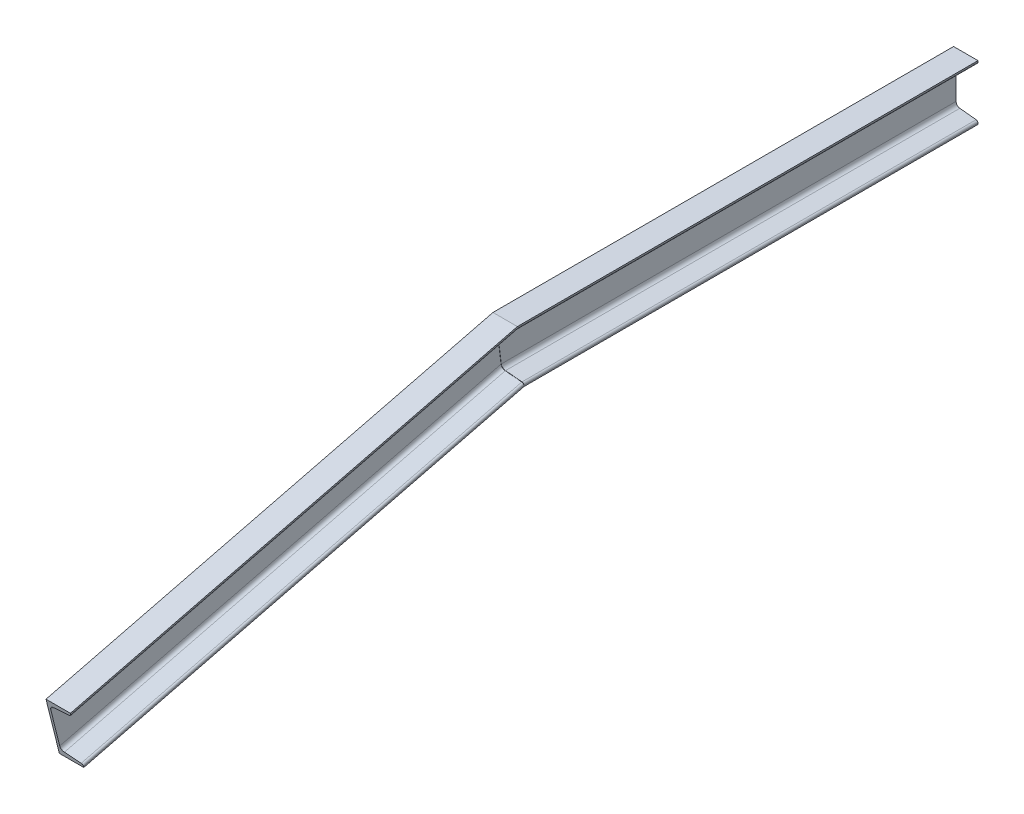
ISO-10303-21;
HEADER;
FILE_DESCRIPTION(('STEP AP214'),'2;1');
FILE_NAME('part.step','',(''),(''),'','','');
FILE_SCHEMA(('AUTOMOTIVE_DESIGN { 1 0 10303 214 1 1 1 1 }'));
ENDSEC;
DATA;
#1=APPLICATION_CONTEXT('core data for automotive mechanical design processes');
#2=APPLICATION_PROTOCOL_DEFINITION('international standard','automotive_design',2000,#1);
#3=PRODUCT_CONTEXT('',#1,'mechanical');
#4=PRODUCT('Part','Part','',(#3));
#5=PRODUCT_RELATED_PRODUCT_CATEGORY('part','',(#4));
#6=PRODUCT_DEFINITION_FORMATION('','',#4);
#7=PRODUCT_DEFINITION_CONTEXT('part definition',#1,'design');
#8=PRODUCT_DEFINITION('design','',#6,#7);
#9=PRODUCT_DEFINITION_SHAPE('','',#8);
#10=(LENGTH_UNIT() NAMED_UNIT(*) SI_UNIT(.MILLI.,.METRE.));
#11=(NAMED_UNIT(*) PLANE_ANGLE_UNIT() SI_UNIT($,.RADIAN.));
#12=(NAMED_UNIT(*) SI_UNIT($,.STERADIAN.) SOLID_ANGLE_UNIT());
#13=UNCERTAINTY_MEASURE_WITH_UNIT(LENGTH_MEASURE(1.E-05),#10,'distance_accuracy_value','');
#14=(GEOMETRIC_REPRESENTATION_CONTEXT(3) GLOBAL_UNCERTAINTY_ASSIGNED_CONTEXT((#13)) GLOBAL_UNIT_ASSIGNED_CONTEXT((#10,
#11,#12)) REPRESENTATION_CONTEXT('',''));
#15=CARTESIAN_POINT('',(0.,0.,0.));
#16=DIRECTION('',(0.,0.,1.));
#17=DIRECTION('',(1.,0.,0.));
#18=AXIS2_PLACEMENT_3D('',#15,#16,#17);
#19=CARTESIAN_POINT('',(53.,-60.,1000.));
#20=DIRECTION('',(-1.,0.,0.));
#21=DIRECTION('',(0.,0.,1.));
#22=AXIS2_PLACEMENT_3D('',#19,#20,#21);
#23=PLANE('',#22);
#24=DIRECTION('',(0.,0.992546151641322,0.121869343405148));
#25=VECTOR('',#24,1.);
#26=CARTESIAN_POINT('',(53.,-58.2421174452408,985.683195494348));
#27=LINE('',#26,#25);
#28=CARTESIAN_POINT('',(53.,-60.048747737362,985.461369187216));
#29=VERTEX_POINT('',#28);
#30=CARTESIAN_POINT('',(53.,-57.5999255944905,985.762046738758));
#31=VERTEX_POINT('',#30);
#32=EDGE_CURVE('E239',#29,#31,#27,.T.);
#33=ORIENTED_EDGE('',*,*,#32,.T.);
#34=DIRECTION('',(0.,0.241921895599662,-0.970295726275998));
#35=VECTOR('',#34,1.);
#36=CARTESIAN_POINT('',(53.,-295.981301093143,1941.85752249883));
#37=LINE('',#36,#35);
#38=CARTESIAN_POINT('',(53.,-295.981301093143,1941.85752249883));
#39=VERTEX_POINT('',#38);
#40=EDGE_CURVE('E294',#39,#31,#37,.T.);
#41=ORIENTED_EDGE('',*,*,#40,.F.);
#42=DIRECTION('',(0.,-0.970295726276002,-0.241921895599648));
#43=VECTOR('',#42,1.);
#44=CARTESIAN_POINT('',(53.,-295.981301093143,1941.85752249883));
#45=LINE('',#44,#43);
#46=CARTESIAN_POINT('',(53.,-298.357382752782,1941.26509880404));
#47=VERTEX_POINT('',#46);
#48=EDGE_CURVE('E280',#39,#47,#45,.T.);
#49=ORIENTED_EDGE('',*,*,#48,.T.);
#50=DIRECTION('',(0.,0.241921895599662,-0.970295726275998));
#51=VECTOR('',#50,1.);
#52=CARTESIAN_POINT('',(53.,-298.357382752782,1941.26509880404));
#53=LINE('',#52,#51);
#54=EDGE_CURVE('E291',#47,#29,#53,.T.);
#55=ORIENTED_EDGE('',*,*,#54,.T.);
#56=EDGE_LOOP('',(#33,#41,#49,#55));
#57=FACE_BOUND('',#56,.T.);
#58=ADVANCED_FACE('F39',(#57),#23,.F.);
#59=CARTESIAN_POINT('',(5.50000000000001,-40.3976442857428,1000.));
#60=DIRECTION('',(-1.,0.,0.));
#61=DIRECTION('',(0.,-1.,0.));
#62=AXIS2_PLACEMENT_3D('',#59,#60,#61);
#63=PLANE('',#62);
#64=DIRECTION('',(0.,0.241921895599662,-0.970295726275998));
#65=VECTOR('',#64,1.);
#66=CARTESIAN_POINT('',(5.50000000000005,-279.337300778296,1946.00733785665));
#67=LINE('',#66,#65);
#68=CARTESIAN_POINT('',(5.50000000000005,-279.337300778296,1946.00733785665));
#69=VERTEX_POINT('',#68);
#70=CARTESIAN_POINT('',(5.50000000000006,-40.4463920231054,987.868235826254));
#71=VERTEX_POINT('',#70);
#72=EDGE_CURVE('E62',#69,#71,#67,.T.);
#73=ORIENTED_EDGE('',*,*,#72,.T.);
#74=DIRECTION('',(0.,0.992546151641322,0.121869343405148));
#75=VECTOR('',#74,1.);
#76=CARTESIAN_POINT('',(5.50000000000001,-38.9308986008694,988.054315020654));
#77=LINE('',#76,#75);
#78=CARTESIAN_POINT('',(5.50000000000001,40.3488965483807,997.788649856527));
#79=VERTEX_POINT('',#78);
#80=EDGE_CURVE('E242',#71,#79,#77,.T.);
#81=ORIENTED_EDGE('',*,*,#80,.T.);
#82=DIRECTION('',(0.,0.241921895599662,-0.970295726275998));
#83=VECTOR('',#82,1.);
#84=CARTESIAN_POINT('',(5.50000000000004,-200.941977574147,1965.55348722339));
#85=LINE('',#84,#83);
#86=CARTESIAN_POINT('',(5.50000000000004,-200.941977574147,1965.55348722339));
#87=VERTEX_POINT('',#86);
#88=EDGE_CURVE('E301',#87,#79,#85,.T.);
#89=ORIENTED_EDGE('',*,*,#88,.F.);
#90=DIRECTION('',(0.,-0.970295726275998,-0.241921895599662));
#91=VECTOR('',#90,1.);
#92=CARTESIAN_POINT('',(5.50000000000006,-200.941977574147,1965.55348722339));
#93=LINE('',#92,#91);
#94=EDGE_CURVE('E269',#87,#69,#93,.T.);
#95=ORIENTED_EDGE('',*,*,#94,.T.);
#96=EDGE_LOOP('',(#73,#81,#89,#95));
#97=FACE_BOUND('',#96,.T.);
#98=ADVANCED_FACE('F456',(#97),#63,.F.);
#99=CARTESIAN_POINT('',(0.,-60.,1000.));
#100=DIRECTION('',(0.,1.,0.));
#101=DIRECTION('',(0.,0.,1.));
#102=AXIS2_PLACEMENT_3D('',#99,#100,#101);
#103=PLANE('',#102);
#104=DIRECTION('',(0.,0.,-1.));
#105=VECTOR('',#104,1.);
#106=CARTESIAN_POINT('',(53.,-60.,1000.));
#107=LINE('',#106,#105);
#108=CARTESIAN_POINT('',(53.,-60.,985.064350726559));
#109=VERTEX_POINT('',#108);
#110=CARTESIAN_POINT('',(53.,-60.,0.));
#111=VERTEX_POINT('',#110);
#112=EDGE_CURVE('E211',#109,#111,#107,.T.);
#113=ORIENTED_EDGE('',*,*,#112,.F.);
#114=DIRECTION('',(-1.,0.,0.));
#115=VECTOR('',#114,1.);
#116=CARTESIAN_POINT('',(0.,-60.,985.064350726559));
#117=LINE('',#116,#115);
#118=CARTESIAN_POINT('',(0.,-60.,985.064350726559));
#119=VERTEX_POINT('',#118);
#120=EDGE_CURVE('E223',#109,#119,#117,.T.);
#121=ORIENTED_EDGE('',*,*,#120,.T.);
#122=DIRECTION('',(0.,0.,-1.));
#123=VECTOR('',#122,1.);
#124=CARTESIAN_POINT('',(0.,-60.,1000.));
#125=LINE('',#124,#123);
#126=CARTESIAN_POINT('',(0.,-60.,0.));
#127=VERTEX_POINT('',#126);
#128=EDGE_CURVE('E373',#119,#127,#125,.T.);
#129=ORIENTED_EDGE('',*,*,#128,.T.);
#130=DIRECTION('',(1.,0.,0.));
#131=VECTOR('',#130,1.);
#132=CARTESIAN_POINT('',(0.,-60.,0.));
#133=LINE('',#132,#131);
#134=EDGE_CURVE('E327',#127,#111,#133,.T.);
#135=ORIENTED_EDGE('',*,*,#134,.T.);
#136=EDGE_LOOP('',(#113,#121,#129,#135));
#137=FACE_BOUND('',#136,.T.);
#138=ADVANCED_FACE('F417',(#137),#103,.F.);
#139=CARTESIAN_POINT('',(53.,60.,1000.));
#140=DIRECTION('',(0.,-1.,0.));
#141=DIRECTION('',(1.,0.,0.));
#142=AXIS2_PLACEMENT_3D('',#139,#140,#141);
#143=PLANE('',#142);
#144=DIRECTION('',(-1.,0.,0.));
#145=VECTOR('',#144,1.);
#146=CARTESIAN_POINT('',(53.,60.,0.));
#147=LINE('',#146,#145);
#148=CARTESIAN_POINT('',(53.,60.,0.));
#149=VERTEX_POINT('',#148);
#150=CARTESIAN_POINT('',(0.,60.,0.));
#151=VERTEX_POINT('',#150);
#152=EDGE_CURVE('E321',#149,#151,#147,.T.);
#153=ORIENTED_EDGE('',*,*,#152,.T.);
#154=DIRECTION('',(0.,0.,-1.));
#155=VECTOR('',#154,1.);
#156=CARTESIAN_POINT('',(0.,60.,1000.));
#157=LINE('',#156,#155);
#158=CARTESIAN_POINT('',(0.,59.9999999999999,1000.));
#159=VERTEX_POINT('',#158);
#160=EDGE_CURVE('E375',#159,#151,#157,.T.);
#161=ORIENTED_EDGE('',*,*,#160,.F.);
#162=DIRECTION('',(-1.,0.,0.));
#163=VECTOR('',#162,1.);
#164=CARTESIAN_POINT('',(53.,60.,1000.));
#165=LINE('',#164,#163);
#166=CARTESIAN_POINT('',(53.,60.,1000.));
#167=VERTEX_POINT('',#166);
#168=EDGE_CURVE('E353',#167,#159,#165,.T.);
#169=ORIENTED_EDGE('',*,*,#168,.F.);
#170=DIRECTION('',(0.,0.,-1.));
#171=VECTOR('',#170,1.);
#172=CARTESIAN_POINT('',(53.,60.,1000.));
#173=LINE('',#172,#171);
#174=EDGE_CURVE('E356',#167,#149,#173,.T.);
#175=ORIENTED_EDGE('',*,*,#174,.T.);
#176=EDGE_LOOP('',(#153,#161,#169,#175));
#177=FACE_BOUND('',#176,.T.);
#178=ADVANCED_FACE('F41',(#177),#143,.F.);
#179=CARTESIAN_POINT('',(0.,60.,1000.));
#180=DIRECTION('',(1.,0.,0.));
#181=DIRECTION('',(0.,1.,0.));
#182=AXIS2_PLACEMENT_3D('',#179,#180,#181);
#183=PLANE('',#182);
#184=DIRECTION('',(0.,0.121869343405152,-0.992546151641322));
#185=VECTOR('',#184,1.);
#186=CARTESIAN_POINT('',(0.,51.2786368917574,999.130653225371));
#187=LINE('',#186,#185);
#188=CARTESIAN_POINT('',(0.,51.2786368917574,999.130653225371));
#189=VERTEX_POINT('',#188);
#190=CARTESIAN_POINT('',(0.,51.3273846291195,998.733634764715));
#191=VERTEX_POINT('',#190);
#192=EDGE_CURVE('E393',#189,#191,#187,.T.);
#193=ORIENTED_EDGE('',*,*,#192,.F.);
#194=DIRECTION('',(0.,0.992546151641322,0.121869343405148));
#195=VECTOR('',#194,1.);
#196=CARTESIAN_POINT('',(0.,-85.3192552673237,982.358541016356));
#197=LINE('',#196,#195);
#198=CARTESIAN_POINT('',(0.,-60.0487477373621,985.461369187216));
#199=VERTEX_POINT('',#198);
#200=EDGE_CURVE('E384',#199,#189,#197,.T.);
#201=ORIENTED_EDGE('',*,*,#200,.F.);
#202=DIRECTION('',(0.,0.241921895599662,-0.970295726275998));
#203=VECTOR('',#202,1.);
#204=CARTESIAN_POINT('',(0.,-298.357382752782,1941.26509880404));
#205=LINE('',#204,#203);
#206=CARTESIAN_POINT('',(0.,-298.357382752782,1941.26509880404));
#207=VERTEX_POINT('',#206);
#208=EDGE_CURVE('E287',#207,#199,#205,.T.);
#209=ORIENTED_EDGE('',*,*,#208,.F.);
#210=DIRECTION('',(0.,0.970295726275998,0.241921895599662));
#211=VECTOR('',#210,1.);
#212=CARTESIAN_POINT('',(0.,-298.357382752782,1941.26509880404));
#213=LINE('',#212,#211);
#214=CARTESIAN_POINT('',(0.,-181.921895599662,1970.295726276));
#215=VERTEX_POINT('',#214);
#216=EDGE_CURVE('E251',#207,#215,#213,.T.);
#217=ORIENTED_EDGE('',*,*,#216,.T.);
#218=DIRECTION('',(0.,0.241921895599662,-0.970295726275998));
#219=VECTOR('',#218,1.);
#220=CARTESIAN_POINT('',(0.,-181.921895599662,1970.295726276));
#221=LINE('',#220,#219);
#222=EDGE_CURVE('E286',#215,#159,#221,.T.);
#223=ORIENTED_EDGE('',*,*,#222,.T.);
#224=ORIENTED_EDGE('',*,*,#160,.T.);
#225=DIRECTION('',(0.,-1.,0.));
#226=VECTOR('',#225,1.);
#227=CARTESIAN_POINT('',(0.,60.,0.));
#228=LINE('',#227,#226);
#229=EDGE_CURVE('E324',#151,#127,#228,.T.);
#230=ORIENTED_EDGE('',*,*,#229,.T.);
#231=ORIENTED_EDGE('',*,*,#128,.F.);
#232=DIRECTION('',(0.,-0.992546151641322,-0.121869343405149));
#233=VECTOR('',#232,1.);
#234=CARTESIAN_POINT('',(0.,51.3273846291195,998.733634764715));
#235=LINE('',#234,#233);
#236=EDGE_CURVE('E395',#191,#119,#235,.T.);
#237=ORIENTED_EDGE('',*,*,#236,.F.);
#238=EDGE_LOOP('',(#193,#201,#209,#217,#223,#224,#230,#231,#237));
#239=FACE_BOUND('',#238,.T.);
#240=ADVANCED_FACE('F389',(#239),#183,.F.);
#241=DIRECTION('',(0.,0.,-1.));
#242=VECTOR('',#241,1.);
#243=CARTESIAN_POINT('',(53.,-57.5511778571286,1000.));
#244=LINE('',#243,#242);
#245=CARTESIAN_POINT('',(53.,-57.5511778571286,985.365028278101));
#246=VERTEX_POINT('',#245);
#247=CARTESIAN_POINT('',(53.,-57.5511778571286,0.));
#248=VERTEX_POINT('',#247);
#249=EDGE_CURVE('E203',#246,#248,#244,.T.);
#250=ORIENTED_EDGE('',*,*,#249,.F.);
#251=DIRECTION('',(0.,-0.992546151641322,-0.121869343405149));
#252=VECTOR('',#251,1.);
#253=CARTESIAN_POINT('',(53.,-58.1933697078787,985.286177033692));
#254=LINE('',#253,#252);
#255=EDGE_CURVE('E206',#246,#109,#254,.T.);
#256=ORIENTED_EDGE('',*,*,#255,.T.);
#257=ORIENTED_EDGE('',*,*,#112,.T.);
#258=DIRECTION('',(0.,1.,0.));
#259=VECTOR('',#258,1.);
#260=CARTESIAN_POINT('',(53.,-60.,0.));
#261=LINE('',#260,#259);
#262=EDGE_CURVE('E209',#111,#248,#261,.T.);
#263=ORIENTED_EDGE('',*,*,#262,.T.);
#264=EDGE_LOOP('',(#250,#256,#257,#263));
#265=FACE_BOUND('',#264,.T.);
#266=ADVANCED_FACE('F204',(#265),#23,.F.);
#267=CARTESIAN_POINT('',(48.5,-57.5511778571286,1000.));
#268=DIRECTION('',(0.,0.,-1.));
#269=DIRECTION('',(-1.,0.,0.));
#270=AXIS2_PLACEMENT_3D('',#267,#268,#269);
#271=CYLINDRICAL_SURFACE('',#270,4.5);
#272=CARTESIAN_POINT('',(48.5,-57.5511778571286,985.365028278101));
#273=DIRECTION('',(0.,0.121869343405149,-0.992546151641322));
#274=DIRECTION('',(0.,-0.992546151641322,-0.121869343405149));
#275=AXIS2_PLACEMENT_3D('',#272,#273,#274);
#276=ELLIPSE('',#275,4.53379421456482,4.5);
#277=CARTESIAN_POINT('',(48.9710815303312,-53.0759033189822,985.914522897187));
#278=VERTEX_POINT('',#277);
#279=EDGE_CURVE('E214',#278,#246,#276,.T.);
#280=ORIENTED_EDGE('',*,*,#279,.T.);
#281=ORIENTED_EDGE('',*,*,#249,.T.);
#282=CARTESIAN_POINT('',(48.5,-57.5511778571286,0.));
#283=DIRECTION('',(0.,0.,1.));
#284=DIRECTION('',(1.,0.,0.));
#285=AXIS2_PLACEMENT_3D('',#282,#283,#284);
#286=CIRCLE('',#285,4.5);
#287=CARTESIAN_POINT('',(48.9710815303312,-53.0759033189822,0.));
#288=VERTEX_POINT('',#287);
#289=EDGE_CURVE('E331',#248,#288,#286,.T.);
#290=ORIENTED_EDGE('',*,*,#289,.T.);
#291=DIRECTION('',(0.,0.,-1.));
#292=VECTOR('',#291,1.);
#293=CARTESIAN_POINT('',(48.9710815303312,-53.0759033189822,1000.));
#294=LINE('',#293,#292);
#295=EDGE_CURVE('E54',#278,#288,#294,.T.);
#296=ORIENTED_EDGE('',*,*,#295,.F.);
#297=EDGE_LOOP('',(#280,#281,#290,#296));
#298=FACE_BOUND('',#297,.T.);
#299=ADVANCED_FACE('F215',(#298),#271,.T.);
#300=CARTESIAN_POINT('',(48.9710815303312,-53.0759033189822,1000.));
#301=DIRECTION('',(-0.104684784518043,-0.994505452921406,0.));
#302=DIRECTION('',(0.994505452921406,-0.104684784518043,0.));
#303=AXIS2_PLACEMENT_3D('',#300,#301,#302);
#304=PLANE('',#303);
#305=DIRECTION('',(0.,0.,-1.));
#306=VECTOR('',#305,1.);
#307=CARTESIAN_POINT('',(13.5578369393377,-49.3481933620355,1000.));
#308=LINE('',#307,#306);
#309=CARTESIAN_POINT('',(13.5578369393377,-49.3481933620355,986.372228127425));
#310=VERTEX_POINT('',#309);
#311=CARTESIAN_POINT('',(13.5578369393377,-49.3481933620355,0.));
#312=VERTEX_POINT('',#311);
#313=EDGE_CURVE('E369',#310,#312,#308,.T.);
#314=ORIENTED_EDGE('',*,*,#313,.F.);
#315=DIRECTION('',(0.994423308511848,-0.104676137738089,-0.0128526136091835));
#316=VECTOR('',#315,1.);
#317=CARTESIAN_POINT('',(11.8829584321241,-49.1718903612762,986.393875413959));
#318=LINE('',#317,#316);
#319=EDGE_CURVE('E218',#310,#278,#318,.T.);
#320=ORIENTED_EDGE('',*,*,#319,.T.);
#321=ORIENTED_EDGE('',*,*,#295,.T.);
#322=DIRECTION('',(-0.994505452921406,0.104684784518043,0.));
#323=VECTOR('',#322,1.);
#324=CARTESIAN_POINT('',(48.9710815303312,-53.0759033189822,0.));
#325=LINE('',#324,#323);
#326=EDGE_CURVE('E333',#288,#312,#325,.T.);
#327=ORIENTED_EDGE('',*,*,#326,.T.);
#328=EDGE_LOOP('',(#314,#320,#321,#327));
#329=FACE_BOUND('',#328,.T.);
#330=ADVANCED_FACE('F422',(#329),#304,.F.);
#331=CARTESIAN_POINT('',(14.5,-40.3976442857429,1000.));
#332=DIRECTION('',(0.,0.,-1.));
#333=DIRECTION('',(-1.,0.,0.));
#334=AXIS2_PLACEMENT_3D('',#331,#332,#333);
#335=CYLINDRICAL_SURFACE('',#334,9.);
#336=DIRECTION('',(0.,0.,-1.));
#337=VECTOR('',#336,1.);
#338=CARTESIAN_POINT('',(5.50000000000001,-40.3976442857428,1000.));
#339=LINE('',#338,#337);
#340=CARTESIAN_POINT('',(5.50000000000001,-40.3976442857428,987.471217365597));
#341=VERTEX_POINT('',#340);
#342=CARTESIAN_POINT('',(5.50000000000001,-40.3976442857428,0.));
#343=VERTEX_POINT('',#342);
#344=EDGE_CURVE('E367',#341,#343,#339,.T.);
#345=ORIENTED_EDGE('',*,*,#344,.F.);
#346=CARTESIAN_POINT('',(14.5,-40.3976442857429,987.471217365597));
#347=DIRECTION('',(0.,0.121869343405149,-0.992546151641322));
#348=DIRECTION('',(0.,-0.992546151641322,-0.121869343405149));
#349=AXIS2_PLACEMENT_3D('',#346,#347,#348);
#350=ELLIPSE('',#349,9.06758842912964,9.);
#351=EDGE_CURVE('E424',#341,#310,#350,.F.);
#352=ORIENTED_EDGE('',*,*,#351,.T.);
#353=ORIENTED_EDGE('',*,*,#313,.T.);
#354=CARTESIAN_POINT('',(14.5,-40.3976442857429,0.));
#355=DIRECTION('',(0.,0.,-1.));
#356=DIRECTION('',(-1.,0.,0.));
#357=AXIS2_PLACEMENT_3D('',#354,#355,#356);
#358=CIRCLE('',#357,9.);
#359=EDGE_CURVE('E336',#312,#343,#358,.T.);
#360=ORIENTED_EDGE('',*,*,#359,.T.);
#361=EDGE_LOOP('',(#345,#352,#353,#360));
#362=FACE_BOUND('',#361,.T.);
#363=ADVANCED_FACE('F565',(#362),#335,.F.);
#364=DIRECTION('',(0.,0.,-1.));
#365=VECTOR('',#364,1.);
#366=CARTESIAN_POINT('',(5.50000000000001,40.3976442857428,1000.));
#367=LINE('',#366,#365);
#368=CARTESIAN_POINT('',(5.50000000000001,40.3976442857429,997.391631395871));
#369=VERTEX_POINT('',#368);
#370=CARTESIAN_POINT('',(5.50000000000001,40.3976442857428,0.));
#371=VERTEX_POINT('',#370);
#372=EDGE_CURVE('E365',#369,#371,#367,.T.);
#373=ORIENTED_EDGE('',*,*,#372,.F.);
#374=DIRECTION('',(0.,-0.992546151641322,-0.121869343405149));
#375=VECTOR('',#374,1.);
#376=CARTESIAN_POINT('',(5.50000000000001,-38.8821508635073,987.657296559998));
#377=LINE('',#376,#375);
#378=EDGE_CURVE('E225',#369,#341,#377,.T.);
#379=ORIENTED_EDGE('',*,*,#378,.T.);
#380=ORIENTED_EDGE('',*,*,#344,.T.);
#381=DIRECTION('',(0.,1.,0.));
#382=VECTOR('',#381,1.);
#383=CARTESIAN_POINT('',(5.50000000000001,-40.3976442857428,0.));
#384=LINE('',#383,#382);
#385=EDGE_CURVE('E339',#343,#371,#384,.T.);
#386=ORIENTED_EDGE('',*,*,#385,.T.);
#387=EDGE_LOOP('',(#373,#379,#380,#386));
#388=FACE_BOUND('',#387,.T.);
#389=ADVANCED_FACE('F483',(#388),#63,.F.);
#390=CARTESIAN_POINT('',(14.5,40.3976442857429,1000.));
#391=DIRECTION('',(0.,0.,-1.));
#392=DIRECTION('',(-1.,0.,0.));
#393=AXIS2_PLACEMENT_3D('',#390,#391,#392);
#394=CYLINDRICAL_SURFACE('',#393,9.);
#395=DIRECTION('',(0.,0.,-1.));
#396=VECTOR('',#395,1.);
#397=CARTESIAN_POINT('',(13.5578369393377,49.3481933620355,1000.));
#398=LINE('',#397,#396);
#399=CARTESIAN_POINT('',(13.5578369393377,49.3481933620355,998.490620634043));
#400=VERTEX_POINT('',#399);
#401=CARTESIAN_POINT('',(13.5578369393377,49.3481933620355,0.));
#402=VERTEX_POINT('',#401);
#403=EDGE_CURVE('E363',#400,#402,#398,.T.);
#404=ORIENTED_EDGE('',*,*,#403,.F.);
#405=CARTESIAN_POINT('',(14.5,40.3976442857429,997.391631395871));
#406=DIRECTION('',(0.,0.121869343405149,-0.992546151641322));
#407=DIRECTION('',(0.,-0.992546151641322,-0.121869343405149));
#408=AXIS2_PLACEMENT_3D('',#405,#406,#407);
#409=ELLIPSE('',#408,9.06758842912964,9.);
#410=EDGE_CURVE('E227',#400,#369,#409,.F.);
#411=ORIENTED_EDGE('',*,*,#410,.T.);
#412=ORIENTED_EDGE('',*,*,#372,.T.);
#413=CARTESIAN_POINT('',(14.5,40.3976442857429,0.));
#414=DIRECTION('',(0.,0.,-1.));
#415=DIRECTION('',(-1.,0.,0.));
#416=AXIS2_PLACEMENT_3D('',#413,#414,#415);
#417=CIRCLE('',#416,9.);
#418=EDGE_CURVE('E342',#371,#402,#417,.T.);
#419=ORIENTED_EDGE('',*,*,#418,.T.);
#420=EDGE_LOOP('',(#404,#411,#412,#419));
#421=FACE_BOUND('',#420,.T.);
#422=ADVANCED_FACE('F550',(#421),#394,.F.);
#423=CARTESIAN_POINT('',(13.5578369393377,49.3481933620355,1000.));
#424=DIRECTION('',(-0.104684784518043,0.994505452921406,0.));
#425=DIRECTION('',(-0.994505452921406,-0.104684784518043,0.));
#426=AXIS2_PLACEMENT_3D('',#423,#424,#425);
#427=PLANE('',#426);
#428=DIRECTION('',(0.994505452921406,0.104684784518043,0.));
#429=VECTOR('',#428,1.);
#430=CARTESIAN_POINT('',(13.5578369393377,49.3481933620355,0.));
#431=LINE('',#430,#429);
#432=CARTESIAN_POINT('',(48.9710815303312,53.0759033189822,0.));
#433=VERTEX_POINT('',#432);
#434=EDGE_CURVE('E345',#402,#433,#431,.T.);
#435=ORIENTED_EDGE('',*,*,#434,.T.);
#436=DIRECTION('',(0.,0.,-1.));
#437=VECTOR('',#436,1.);
#438=CARTESIAN_POINT('',(48.9710815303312,53.0759033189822,1000.));
#439=LINE('',#438,#437);
#440=CARTESIAN_POINT('',(48.9710815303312,53.0759033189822,999.149827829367));
#441=VERTEX_POINT('',#440);
#442=EDGE_CURVE('E361',#441,#433,#439,.T.);
#443=ORIENTED_EDGE('',*,*,#442,.F.);
#444=DIRECTION('',(-0.994423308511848,-0.104676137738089,-0.0128526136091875));
#445=VECTOR('',#444,1.);
#446=CARTESIAN_POINT('',(13.5745528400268,49.3499529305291,998.692338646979));
#447=LINE('',#446,#445);
#448=CARTESIAN_POINT('',(32.1286022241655,51.3030107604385,998.932143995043));
#449=VERTEX_POINT('',#448);
#450=EDGE_CURVE('E318',#441,#449,#447,.T.);
#451=ORIENTED_EDGE('',*,*,#450,.T.);
#452=DIRECTION('',(0.756785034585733,0.079661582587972,-0.648791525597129));
#453=VECTOR('',#452,1.);
#454=CARTESIAN_POINT('',(20.8505246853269,50.1158447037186,1008.6008356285));
#455=LINE('',#454,#453);
#456=CARTESIAN_POINT('',(32.3601539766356,51.3273846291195,998.733634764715));
#457=VERTEX_POINT('',#456);
#458=EDGE_CURVE('E248',#449,#457,#455,.T.);
#459=ORIENTED_EDGE('',*,*,#458,.T.);
#460=DIRECTION('',(-0.994423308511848,-0.104676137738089,-0.0128526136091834));
#461=VECTOR('',#460,1.);
#462=CARTESIAN_POINT('',(13.57712822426,49.3502240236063,998.490869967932));
#463=LINE('',#462,#461);
#464=EDGE_CURVE('E236',#457,#400,#463,.T.);
#465=ORIENTED_EDGE('',*,*,#464,.T.);
#466=ORIENTED_EDGE('',*,*,#403,.T.);
#467=EDGE_LOOP('',(#435,#443,#451,#459,#465,#466));
#468=FACE_BOUND('',#467,.T.);
#469=ADVANCED_FACE('F542',(#468),#427,.F.);
#470=CARTESIAN_POINT('',(48.5,57.5511778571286,1000.));
#471=DIRECTION('',(0.,0.,-1.));
#472=DIRECTION('',(-1.,0.,0.));
#473=AXIS2_PLACEMENT_3D('',#470,#471,#472);
#474=CYLINDRICAL_SURFACE('',#473,4.5);
#475=CARTESIAN_POINT('',(48.5,57.5511778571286,0.));
#476=DIRECTION('',(0.,0.,1.));
#477=DIRECTION('',(1.,0.,0.));
#478=AXIS2_PLACEMENT_3D('',#475,#476,#477);
#479=CIRCLE('',#478,4.5);
#480=CARTESIAN_POINT('',(53.,57.5511778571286,0.));
#481=VERTEX_POINT('',#480);
#482=EDGE_CURVE('E348',#433,#481,#479,.T.);
#483=ORIENTED_EDGE('',*,*,#482,.T.);
#484=DIRECTION('',(0.,0.,-1.));
#485=VECTOR('',#484,1.);
#486=CARTESIAN_POINT('',(53.,57.5511778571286,1000.));
#487=LINE('',#486,#485);
#488=CARTESIAN_POINT('',(53.,57.5511778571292,999.699322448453));
#489=VERTEX_POINT('',#488);
#490=EDGE_CURVE('E359',#489,#481,#487,.T.);
#491=ORIENTED_EDGE('',*,*,#490,.F.);
#492=CARTESIAN_POINT('',(48.5,57.5511778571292,999.699322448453));
#493=DIRECTION('',(0.,0.121869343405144,-0.992546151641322));
#494=DIRECTION('',(0.,-0.992546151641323,-0.121869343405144));
#495=AXIS2_PLACEMENT_3D('',#492,#493,#494);
#496=ELLIPSE('',#495,4.53379421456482,4.50000000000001);
#497=EDGE_CURVE('E290',#489,#441,#496,.T.);
#498=ORIENTED_EDGE('',*,*,#497,.T.);
#499=ORIENTED_EDGE('',*,*,#442,.T.);
#500=EDGE_LOOP('',(#483,#491,#498,#499));
#501=FACE_BOUND('',#500,.T.);
#502=ADVANCED_FACE('F532',(#501),#474,.T.);
#503=CARTESIAN_POINT('',(53.,57.5511778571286,1000.));
#504=DIRECTION('',(-1.,0.,0.));
#505=DIRECTION('',(0.,0.,1.));
#506=AXIS2_PLACEMENT_3D('',#503,#504,#505);
#507=PLANE('',#506);
#508=DIRECTION('',(0.,0.241921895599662,-0.970295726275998));
#509=VECTOR('',#508,1.);
#510=CARTESIAN_POINT('',(53.,-184.2979772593,1969.70330258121));
#511=LINE('',#510,#509);
#512=CARTESIAN_POINT('',(53.,-184.2979772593,1969.70330258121));
#513=VERTEX_POINT('',#512);
#514=EDGE_CURVE('E309',#513,#489,#511,.T.);
#515=ORIENTED_EDGE('',*,*,#514,.T.);
#516=ORIENTED_EDGE('',*,*,#490,.T.);
#517=DIRECTION('',(0.,1.,0.));
#518=VECTOR('',#517,1.);
#519=CARTESIAN_POINT('',(53.,57.5511778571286,0.));
#520=LINE('',#519,#518);
#521=EDGE_CURVE('E351',#481,#149,#520,.T.);
#522=ORIENTED_EDGE('',*,*,#521,.T.);
#523=ORIENTED_EDGE('',*,*,#174,.F.);
#524=DIRECTION('',(0.,0.241921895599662,-0.970295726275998));
#525=VECTOR('',#524,1.);
#526=CARTESIAN_POINT('',(53.,-181.921895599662,1970.295726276));
#527=LINE('',#526,#525);
#528=CARTESIAN_POINT('',(53.,-181.921895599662,1970.295726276));
#529=VERTEX_POINT('',#528);
#530=EDGE_CURVE('E311',#529,#167,#527,.T.);
#531=ORIENTED_EDGE('',*,*,#530,.F.);
#532=DIRECTION('',(0.,-0.970295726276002,-0.241921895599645));
#533=VECTOR('',#532,1.);
#534=CARTESIAN_POINT('',(53.,-181.921895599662,1970.295726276));
#535=LINE('',#534,#533);
#536=EDGE_CURVE('E257',#529,#513,#535,.T.);
#537=ORIENTED_EDGE('',*,*,#536,.T.);
#538=EDGE_LOOP('',(#515,#516,#522,#523,#531,#537));
#539=FACE_BOUND('',#538,.T.);
#540=ADVANCED_FACE('F523',(#539),#507,.F.);
#541=CARTESIAN_POINT('',(48.5,-57.5511778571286,0.));
#542=DIRECTION('',(0.,0.,1.));
#543=DIRECTION('',(1.,0.,0.));
#544=AXIS2_PLACEMENT_3D('',#541,#542,#543);
#545=PLANE('',#544);
#546=ORIENTED_EDGE('',*,*,#152,.F.);
#547=ORIENTED_EDGE('',*,*,#521,.F.);
#548=ORIENTED_EDGE('',*,*,#482,.F.);
#549=ORIENTED_EDGE('',*,*,#434,.F.);
#550=ORIENTED_EDGE('',*,*,#418,.F.);
#551=ORIENTED_EDGE('',*,*,#385,.F.);
#552=ORIENTED_EDGE('',*,*,#359,.F.);
#553=ORIENTED_EDGE('',*,*,#326,.F.);
#554=ORIENTED_EDGE('',*,*,#289,.F.);
#555=ORIENTED_EDGE('',*,*,#262,.F.);
#556=ORIENTED_EDGE('',*,*,#134,.F.);
#557=ORIENTED_EDGE('',*,*,#229,.F.);
#558=EDGE_LOOP('',(#546,#547,#548,#549,#550,#551,#552,#553,#554,#555,#556,#557));
#559=FACE_BOUND('',#558,.T.);
#560=ADVANCED_FACE('F412',(#559),#545,.F.);
#561=CARTESIAN_POINT('',(48.5,-184.2979772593,1969.70330258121));
#562=DIRECTION('',(0.,0.241921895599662,-0.970295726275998));
#563=DIRECTION('',(0.,0.970295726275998,0.241921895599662));
#564=AXIS2_PLACEMENT_3D('',#561,#562,#563);
#565=PLANE('',#564);
#566=ORIENTED_EDGE('',*,*,#216,.F.);
#567=DIRECTION('',(-1.,0.,0.));
#568=VECTOR('',#567,1.);
#569=CARTESIAN_POINT('',(53.,-298.357382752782,1941.26509880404));
#570=LINE('',#569,#568);
#571=EDGE_CURVE('E283',#47,#207,#570,.T.);
#572=ORIENTED_EDGE('',*,*,#571,.F.);
#573=ORIENTED_EDGE('',*,*,#48,.F.);
#574=CARTESIAN_POINT('',(48.5,-295.981301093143,1941.85752249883));
#575=DIRECTION('',(0.,0.241921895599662,-0.970295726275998));
#576=DIRECTION('',(0.,0.970295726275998,0.241921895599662));
#577=AXIS2_PLACEMENT_3D('',#574,#575,#576);
#578=CIRCLE('',#577,4.5);
#579=CARTESIAN_POINT('',(48.9710815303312,-291.638961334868,1942.94018939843));
#580=VERTEX_POINT('',#579);
#581=EDGE_CURVE('E277',#580,#39,#578,.T.);
#582=ORIENTED_EDGE('',*,*,#581,.F.);
#583=DIRECTION('',(0.994505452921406,-0.10157519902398,-0.0253255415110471));
#584=VECTOR('',#583,1.);
#585=CARTESIAN_POINT('',(13.5578369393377,-288.021980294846,1943.84200405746));
#586=LINE('',#585,#584);
#587=CARTESIAN_POINT('',(13.5578369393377,-288.021980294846,1943.84200405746));
#588=VERTEX_POINT('',#587);
#589=EDGE_CURVE('E274',#588,#580,#586,.T.);
#590=ORIENTED_EDGE('',*,*,#589,.F.);
#591=CARTESIAN_POINT('',(14.5000000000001,-279.337300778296,1946.00733785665));
#592=DIRECTION('',(0.,-0.241921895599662,0.970295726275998));
#593=DIRECTION('',(0.,-0.970295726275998,-0.241921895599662));
#594=AXIS2_PLACEMENT_3D('',#591,#592,#593);
#595=CIRCLE('',#594,9.);
#596=EDGE_CURVE('E271',#69,#588,#595,.T.);
#597=ORIENTED_EDGE('',*,*,#596,.F.);
#598=ORIENTED_EDGE('',*,*,#94,.F.);
#599=CARTESIAN_POINT('',(14.5000000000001,-200.941977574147,1965.55348722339));
#600=DIRECTION('',(0.,-0.241921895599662,0.970295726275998));
#601=DIRECTION('',(0.,-0.970295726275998,-0.241921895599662));
#602=AXIS2_PLACEMENT_3D('',#599,#600,#601);
#603=CIRCLE('',#602,9.00000000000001);
#604=CARTESIAN_POINT('',(13.5578369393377,-192.257298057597,1967.71882102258));
#605=VERTEX_POINT('',#604);
#606=EDGE_CURVE('E266',#605,#87,#603,.T.);
#607=ORIENTED_EDGE('',*,*,#606,.F.);
#608=DIRECTION('',(-0.994505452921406,-0.101575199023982,-0.025325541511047));
#609=VECTOR('',#608,1.);
#610=CARTESIAN_POINT('',(48.9710815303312,-188.640317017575,1968.62063568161));
#611=LINE('',#610,#609);
#612=CARTESIAN_POINT('',(48.9710815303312,-188.640317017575,1968.62063568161));
#613=VERTEX_POINT('',#612);
#614=EDGE_CURVE('E263',#613,#605,#611,.T.);
#615=ORIENTED_EDGE('',*,*,#614,.F.);
#616=CARTESIAN_POINT('',(48.5,-184.2979772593,1969.70330258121));
#617=DIRECTION('',(0.,0.241921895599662,-0.970295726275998));
#618=DIRECTION('',(0.,0.970295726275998,0.241921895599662));
#619=AXIS2_PLACEMENT_3D('',#616,#617,#618);
#620=CIRCLE('',#619,4.50000000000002);
#621=EDGE_CURVE('E260',#513,#613,#620,.T.);
#622=ORIENTED_EDGE('',*,*,#621,.F.);
#623=ORIENTED_EDGE('',*,*,#536,.F.);
#624=DIRECTION('',(1.,0.,0.));
#625=VECTOR('',#624,1.);
#626=CARTESIAN_POINT('',(0.,-181.921895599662,1970.295726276));
#627=LINE('',#626,#625);
#628=EDGE_CURVE('E254',#215,#529,#627,.T.);
#629=ORIENTED_EDGE('',*,*,#628,.F.);
#630=EDGE_LOOP('',(#566,#572,#573,#582,#590,#597,#598,#607,#615,#622,#623,#629));
#631=FACE_BOUND('',#630,.T.);
#632=ADVANCED_FACE('F401',(#631),#565,.F.);
#633=CARTESIAN_POINT('',(14.5000000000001,-279.337300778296,1946.00733785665));
#634=DIRECTION('',(0.,0.241921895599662,-0.970295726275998));
#635=DIRECTION('',(0.,0.970295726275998,0.241921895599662));
#636=AXIS2_PLACEMENT_3D('',#633,#634,#635);
#637=CYLINDRICAL_SURFACE('',#636,9.);
#638=DIRECTION('',(0.,0.241921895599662,-0.970295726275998));
#639=VECTOR('',#638,1.);
#640=CARTESIAN_POINT('',(13.5578369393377,-288.021980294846,1943.84200405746));
#641=LINE('',#640,#639);
#642=CARTESIAN_POINT('',(13.5578369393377,-49.3969410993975,986.769246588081));
#643=VERTEX_POINT('',#642);
#644=EDGE_CURVE('E298',#588,#643,#641,.T.);
#645=ORIENTED_EDGE('',*,*,#644,.T.);
#646=CARTESIAN_POINT('',(14.5,-40.4463920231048,987.868235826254));
#647=DIRECTION('',(0.,-0.121869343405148,0.992546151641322));
#648=DIRECTION('',(0.,-0.992546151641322,-0.121869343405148));
#649=AXIS2_PLACEMENT_3D('',#646,#647,#648);
#650=ELLIPSE('',#649,9.06758842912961,8.99999999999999);
#651=EDGE_CURVE('E426',#643,#71,#650,.F.);
#652=ORIENTED_EDGE('',*,*,#651,.T.);
#653=ORIENTED_EDGE('',*,*,#72,.F.);
#654=ORIENTED_EDGE('',*,*,#596,.T.);
#655=EDGE_LOOP('',(#645,#652,#653,#654));
#656=FACE_BOUND('',#655,.T.);
#657=ADVANCED_FACE('F459',(#656),#637,.F.);
#658=CARTESIAN_POINT('',(13.5578369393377,-288.021980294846,1943.84200405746));
#659=DIRECTION('',(0.104684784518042,0.964964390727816,0.240592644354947));
#660=DIRECTION('',(0.,-0.241921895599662,0.970295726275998));
#661=AXIS2_PLACEMENT_3D('',#658,#659,#660);
#662=PLANE('',#661);
#663=DIRECTION('',(0.,0.241921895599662,-0.970295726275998));
#664=VECTOR('',#663,1.);
#665=CARTESIAN_POINT('',(48.9710815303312,-291.638961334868,1942.94018939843));
#666=LINE('',#665,#664);
#667=CARTESIAN_POINT('',(48.9710815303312,-53.1246510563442,986.311541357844));
#668=VERTEX_POINT('',#667);
#669=EDGE_CURVE('E296',#580,#668,#666,.T.);
#670=ORIENTED_EDGE('',*,*,#669,.T.);
#671=DIRECTION('',(-0.994423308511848,0.10467613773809,0.0128526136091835));
#672=VECTOR('',#671,1.);
#673=CARTESIAN_POINT('',(47.2903531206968,-52.9477322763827,986.333264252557));
#674=LINE('',#673,#672);
#675=EDGE_CURVE('E431',#668,#643,#674,.T.);
#676=ORIENTED_EDGE('',*,*,#675,.T.);
#677=ORIENTED_EDGE('',*,*,#644,.F.);
#678=ORIENTED_EDGE('',*,*,#589,.T.);
#679=EDGE_LOOP('',(#670,#676,#677,#678));
#680=FACE_BOUND('',#679,.T.);
#681=ADVANCED_FACE('F461',(#680),#662,.T.);
#682=CARTESIAN_POINT('',(48.5,-295.981301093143,1941.85752249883));
#683=DIRECTION('',(0.,0.241921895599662,-0.970295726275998));
#684=DIRECTION('',(0.,0.970295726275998,0.241921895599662));
#685=AXIS2_PLACEMENT_3D('',#682,#683,#684);
#686=CYLINDRICAL_SURFACE('',#685,4.5);
#687=ORIENTED_EDGE('',*,*,#40,.T.);
#688=CARTESIAN_POINT('',(48.5,-57.5999255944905,985.762046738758));
#689=DIRECTION('',(0.,-0.121869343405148,0.992546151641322));
#690=DIRECTION('',(0.,-0.992546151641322,-0.121869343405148));
#691=AXIS2_PLACEMENT_3D('',#688,#689,#690);
#692=ELLIPSE('',#691,4.53379421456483,4.50000000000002);
#693=EDGE_CURVE('E434',#31,#668,#692,.T.);
#694=ORIENTED_EDGE('',*,*,#693,.T.);
#695=ORIENTED_EDGE('',*,*,#669,.F.);
#696=ORIENTED_EDGE('',*,*,#581,.T.);
#697=EDGE_LOOP('',(#687,#694,#695,#696));
#698=FACE_BOUND('',#697,.T.);
#699=ADVANCED_FACE('F464',(#698),#686,.T.);
#700=CARTESIAN_POINT('',(0.,-181.921895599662,1970.295726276));
#701=DIRECTION('',(0.,0.970295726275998,0.241921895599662));
#702=DIRECTION('',(0.,-0.241921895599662,0.970295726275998));
#703=AXIS2_PLACEMENT_3D('',#700,#701,#702);
#704=PLANE('',#703);
#705=ORIENTED_EDGE('',*,*,#168,.T.);
#706=ORIENTED_EDGE('',*,*,#222,.F.);
#707=ORIENTED_EDGE('',*,*,#628,.T.);
#708=ORIENTED_EDGE('',*,*,#530,.T.);
#709=EDGE_LOOP('',(#705,#706,#707,#708));
#710=FACE_BOUND('',#709,.T.);
#711=ADVANCED_FACE('F407',(#710),#704,.T.);
#712=CARTESIAN_POINT('',(48.5,-184.2979772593,1969.70330258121));
#713=DIRECTION('',(0.,0.241921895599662,-0.970295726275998));
#714=DIRECTION('',(0.,0.970295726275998,0.241921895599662));
#715=AXIS2_PLACEMENT_3D('',#712,#713,#714);
#716=CYLINDRICAL_SURFACE('',#715,4.50000000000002);
#717=DIRECTION('',(0.,0.241921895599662,-0.970295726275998));
#718=VECTOR('',#717,1.);
#719=CARTESIAN_POINT('',(48.9710815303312,-188.640317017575,1968.62063568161));
#720=LINE('',#719,#718);
#721=EDGE_CURVE('E307',#613,#441,#720,.T.);
#722=ORIENTED_EDGE('',*,*,#721,.T.);
#723=ORIENTED_EDGE('',*,*,#497,.F.);
#724=ORIENTED_EDGE('',*,*,#514,.F.);
#725=ORIENTED_EDGE('',*,*,#621,.T.);
#726=EDGE_LOOP('',(#722,#723,#724,#725));
#727=FACE_BOUND('',#726,.T.);
#728=ADVANCED_FACE('F472',(#727),#716,.T.);
#729=CARTESIAN_POINT('',(48.9710815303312,-188.640317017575,1968.62063568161));
#730=DIRECTION('',(0.104684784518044,-0.964964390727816,-0.240592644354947));
#731=DIRECTION('',(0.,0.241921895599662,-0.970295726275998));
#732=AXIS2_PLACEMENT_3D('',#729,#730,#731);
#733=PLANE('',#732);
#734=DIRECTION('',(-0.994423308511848,-0.10467613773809,-0.0128526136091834));
#735=VECTOR('',#734,1.);
#736=CARTESIAN_POINT('',(36.2035843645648,51.6832085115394,999.18032837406));
#737=LINE('',#736,#735);
#738=CARTESIAN_POINT('',(32.3601539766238,51.2786368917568,999.130653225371));
#739=VERTEX_POINT('',#738);
#740=CARTESIAN_POINT('',(13.5578369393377,49.2994456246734,998.8876390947));
#741=VERTEX_POINT('',#740);
#742=EDGE_CURVE('E246',#739,#741,#737,.T.);
#743=ORIENTED_EDGE('',*,*,#742,.F.);
#744=DIRECTION('',(0.756785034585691,-0.0796615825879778,0.648791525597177));
#745=VECTOR('',#744,1.);
#746=CARTESIAN_POINT('',(532.352973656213,-1.3521862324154,1427.77430953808));
#747=LINE('',#746,#745);
#748=EDGE_CURVE('E11',#449,#739,#747,.T.);
#749=ORIENTED_EDGE('',*,*,#748,.F.);
#750=ORIENTED_EDGE('',*,*,#450,.F.);
#751=ORIENTED_EDGE('',*,*,#721,.F.);
#752=ORIENTED_EDGE('',*,*,#614,.T.);
#753=DIRECTION('',(0.,0.241921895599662,-0.970295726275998));
#754=VECTOR('',#753,1.);
#755=CARTESIAN_POINT('',(13.5578369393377,-192.257298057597,1967.71882102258));
#756=LINE('',#755,#754);
#757=EDGE_CURVE('E304',#605,#741,#756,.T.);
#758=ORIENTED_EDGE('',*,*,#757,.T.);
#759=EDGE_LOOP('',(#743,#749,#750,#751,#752,#758));
#760=FACE_BOUND('',#759,.T.);
#761=ADVANCED_FACE('F446',(#760),#733,.T.);
#762=CARTESIAN_POINT('',(14.5000000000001,-200.941977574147,1965.55348722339));
#763=DIRECTION('',(0.,0.241921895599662,-0.970295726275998));
#764=DIRECTION('',(0.,0.970295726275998,0.241921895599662));
#765=AXIS2_PLACEMENT_3D('',#762,#763,#764);
#766=CYLINDRICAL_SURFACE('',#765,9.00000000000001);
#767=CARTESIAN_POINT('',(14.5,40.3488965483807,997.788649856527));
#768=DIRECTION('',(0.,-0.121869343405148,0.992546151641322));
#769=DIRECTION('',(0.,0.992546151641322,0.121869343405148));
#770=AXIS2_PLACEMENT_3D('',#767,#768,#769);
#771=ELLIPSE('',#770,9.06758842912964,9.00000000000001);
#772=EDGE_CURVE('E244',#741,#79,#771,.T.);
#773=ORIENTED_EDGE('',*,*,#772,.F.);
#774=ORIENTED_EDGE('',*,*,#757,.F.);
#775=ORIENTED_EDGE('',*,*,#606,.T.);
#776=ORIENTED_EDGE('',*,*,#88,.T.);
#777=EDGE_LOOP('',(#773,#774,#775,#776));
#778=FACE_BOUND('',#777,.T.);
#779=ADVANCED_FACE('F451',(#778),#766,.F.);
#780=CARTESIAN_POINT('',(53.,-298.357382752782,1941.26509880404));
#781=DIRECTION('',(0.,-0.970295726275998,-0.241921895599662));
#782=DIRECTION('',(0.,0.241921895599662,-0.970295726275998));
#783=AXIS2_PLACEMENT_3D('',#780,#781,#782);
#784=PLANE('',#783);
#785=DIRECTION('',(-1.,0.,0.));
#786=VECTOR('',#785,1.);
#787=CARTESIAN_POINT('',(53.,-60.048747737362,985.461369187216));
#788=LINE('',#787,#786);
#789=EDGE_CURVE('E47',#29,#199,#788,.T.);
#790=ORIENTED_EDGE('',*,*,#789,.F.);
#791=ORIENTED_EDGE('',*,*,#54,.F.);
#792=ORIENTED_EDGE('',*,*,#571,.T.);
#793=ORIENTED_EDGE('',*,*,#208,.T.);
#794=EDGE_LOOP('',(#790,#791,#792,#793));
#795=FACE_BOUND('',#794,.T.);
#796=ADVANCED_FACE('F397',(#795),#784,.T.);
#797=CARTESIAN_POINT('',(1000.,51.2786368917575,999.130653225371));
#798=DIRECTION('',(0.,0.992546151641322,0.121869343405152));
#799=DIRECTION('',(0.,-0.121869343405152,0.992546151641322));
#800=AXIS2_PLACEMENT_3D('',#797,#798,#799);
#801=PLANE('',#800);
#802=ORIENTED_EDGE('',*,*,#748,.T.);
#803=DIRECTION('',(-1.,0.,0.));
#804=VECTOR('',#803,1.);
#805=CARTESIAN_POINT('',(1000.,51.2786368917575,999.130653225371));
#806=LINE('',#805,#804);
#807=EDGE_CURVE('E230',#739,#189,#806,.T.);
#808=ORIENTED_EDGE('',*,*,#807,.T.);
#809=ORIENTED_EDGE('',*,*,#192,.T.);
#810=DIRECTION('',(-1.,0.,0.));
#811=VECTOR('',#810,1.);
#812=CARTESIAN_POINT('',(1000.,51.3273846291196,998.733634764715));
#813=LINE('',#812,#811);
#814=EDGE_CURVE('E394',#457,#191,#813,.T.);
#815=ORIENTED_EDGE('',*,*,#814,.F.);
#816=ORIENTED_EDGE('',*,*,#458,.F.);
#817=EDGE_LOOP('',(#802,#808,#809,#815,#816));
#818=FACE_BOUND('',#817,.T.);
#819=ADVANCED_FACE('F441',(#818),#801,.F.);
#820=CARTESIAN_POINT('',(1000.,51.3273846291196,998.733634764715));
#821=DIRECTION('',(0.,0.121869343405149,-0.992546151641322));
#822=DIRECTION('',(0.,0.992546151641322,0.121869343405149));
#823=AXIS2_PLACEMENT_3D('',#820,#821,#822);
#824=PLANE('',#823);
#825=ORIENTED_EDGE('',*,*,#351,.F.);
#826=ORIENTED_EDGE('',*,*,#378,.F.);
#827=ORIENTED_EDGE('',*,*,#410,.F.);
#828=ORIENTED_EDGE('',*,*,#464,.F.);
#829=ORIENTED_EDGE('',*,*,#814,.T.);
#830=ORIENTED_EDGE('',*,*,#236,.T.);
#831=ORIENTED_EDGE('',*,*,#120,.F.);
#832=ORIENTED_EDGE('',*,*,#255,.F.);
#833=ORIENTED_EDGE('',*,*,#279,.F.);
#834=ORIENTED_EDGE('',*,*,#319,.F.);
#835=EDGE_LOOP('',(#825,#826,#827,#828,#829,#830,#831,#832,#833,#834));
#836=FACE_BOUND('',#835,.T.);
#837=ADVANCED_FACE('F221',(#836),#824,.F.);
#838=CARTESIAN_POINT('',(1000.,-85.3192552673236,982.358541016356));
#839=DIRECTION('',(0.,-0.121869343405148,0.992546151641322));
#840=DIRECTION('',(0.,-0.992546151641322,-0.121869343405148));
#841=AXIS2_PLACEMENT_3D('',#838,#839,#840);
#842=PLANE('',#841);
#843=ORIENTED_EDGE('',*,*,#675,.F.);
#844=ORIENTED_EDGE('',*,*,#693,.F.);
#845=ORIENTED_EDGE('',*,*,#32,.F.);
#846=ORIENTED_EDGE('',*,*,#789,.T.);
#847=ORIENTED_EDGE('',*,*,#200,.T.);
#848=ORIENTED_EDGE('',*,*,#807,.F.);
#849=ORIENTED_EDGE('',*,*,#742,.T.);
#850=ORIENTED_EDGE('',*,*,#772,.T.);
#851=ORIENTED_EDGE('',*,*,#80,.F.);
#852=ORIENTED_EDGE('',*,*,#651,.F.);
#853=EDGE_LOOP('',(#843,#844,#845,#846,#847,#848,#849,#850,#851,#852));
#854=FACE_BOUND('',#853,.T.);
#855=ADVANCED_FACE('F382',(#854),#842,.F.);
#856=CLOSED_SHELL('',(#58,#98,#138,#178,#240,#266,#299,#330,#363,#389,#422,#469,#502,#540,#560,
#632,#657,#681,#699,#711,#728,#761,#779,#796,#819,#837,#855));
#857=MANIFOLD_SOLID_BREP('B2',#856);
#858=ADVANCED_BREP_SHAPE_REPRESENTATION('',(#18,#857),#14);
#859=SHAPE_DEFINITION_REPRESENTATION(#9,#858);
ENDSEC;
END-ISO-10303-21;
